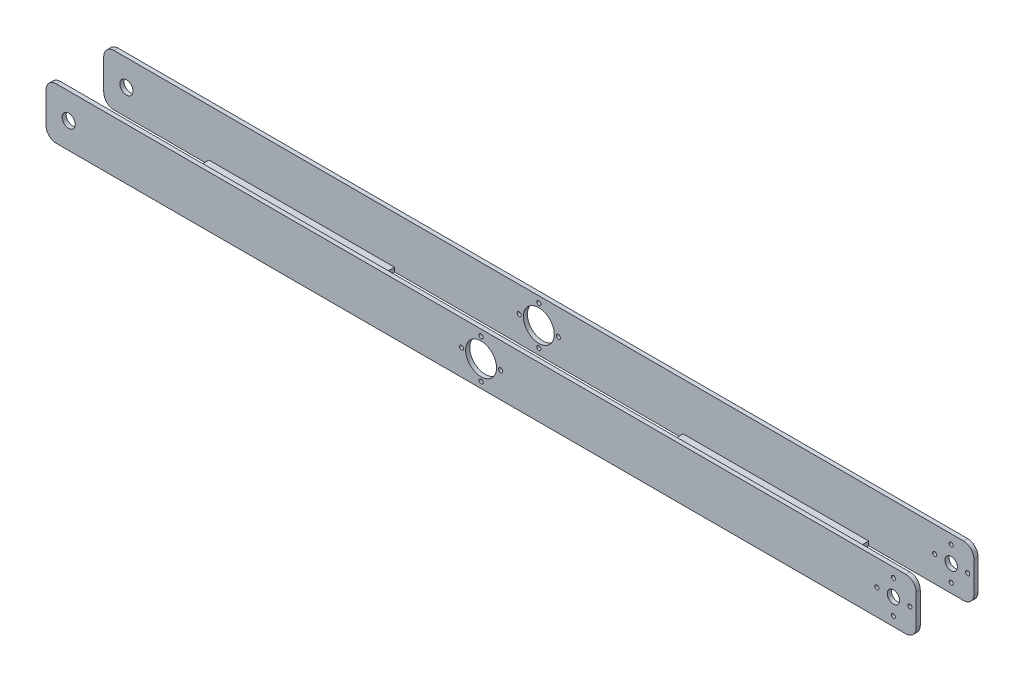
from build123d import *

# Parameters (mm, degrees)
SKETCH1_W               = 422
SKETCH1_H               = 25
BOSS_EXTRUDE1_DEPTH     = 30
SHELL1_T                = -2
SKETCH2_W               = 51
SKETCH2_H               = 26
SKETCH2_W_2             = 140
CUT_EXTRUDE1_DEPTH      = 215.583317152
SKETCH4_R               = 7.5
SKETCH4_R_2             = 3.2
SKETCH4_R_3             = 1
CUT_EXTRUDE3_DEPTH      = 214.488290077
CUT_EXTRUDE4_DEPTH      = 214.488290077
CUT_EXTRUDE4_DEPTH_BACK = 214.488290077
SKETCH5_R               = 3
SKETCH5_R_2             = 1
FILLET2_R               = 5


with BuildPart() as part:
    # Sketch1 → Boss-Extrude1 (new body)
    with BuildSketch(Plane.XY):
        Rectangle(SKETCH1_W, SKETCH1_H)
    extrude(amount=BOSS_EXTRUDE1_DEPTH)

    # Shell1
    shell1_openings = [part.faces().sort_by_distance(p)[0] for p in [
        (-211, 0, 15),
        (0, 12.5, 15),
        (211, 0, 15),
    ]]
    offset(amount=SHELL1_T, openings=shell1_openings, kind=Kind.INTERSECTION)

    # Sketch2 → Cut-Extrude1 (cut, through all)
    with BuildSketch(Plane(origin=(0, 12.5, 0), x_dir=(1, 0, 0), z_dir=(0, 1, 0))):
        with Locations((-185.5, -15)):
            Rectangle(SKETCH2_W, SKETCH2_H)
        with Locations((185.5, -15)):
            Rectangle(SKETCH2_W, SKETCH2_H)
        with Locations((0, -15)):
            Rectangle(SKETCH2_W_2, SKETCH2_H)
    extrude(amount=-CUT_EXTRUDE1_DEPTH, mode=Mode.SUBTRACT)

    # Sketch4 → Cut-Extrude3 (cut, through all)
    with BuildSketch(Plane.XY.offset(30)):
        Circle(SKETCH4_R)
        with Locations((-200, 0)):
            Circle(SKETCH4_R_2)
        with Locations((0, 9.5)):
            Circle(SKETCH4_R_3)
        with Locations((9.5, 0)):
            Circle(SKETCH4_R_3)
        with Locations((0, -9.5)):
            Circle(SKETCH4_R_3)
        with Locations((-9.5, 0)):
            Circle(SKETCH4_R_3)
    extrude(amount=-CUT_EXTRUDE3_DEPTH, mode=Mode.SUBTRACT)

    # Sketch5 → Cut-Extrude4 (cut, two sides: drawn at the far end of the back side and taken through both)
    with BuildSketch(Plane(origin=(0, 0, 0), x_dir=(-1, 0, 0), z_dir=(0, 0, -1)).offset(-CUT_EXTRUDE4_DEPTH_BACK)):
        with Locations(Location((-200, 0, 0), (0, 0, 180))):
            Circle(SKETCH5_R)
        with Locations(Location((-200, 8, 0), (0, 0, 180))):
            Circle(SKETCH5_R_2)
        with Locations(Location((-192, 0, 0), (0, 0, 180))):
            Circle(SKETCH5_R_2)
        with Locations(Location((-208, 0, 0), (0, 0, 180))):
            Circle(SKETCH5_R_2)
        with Locations(Location((-200, -8, 0), (0, 0, 180))):
            Circle(SKETCH5_R_2)
    extrude(amount=CUT_EXTRUDE4_DEPTH + CUT_EXTRUDE4_DEPTH_BACK, mode=Mode.SUBTRACT)

    # Fillet2
    fillet2_edges = [part.edges().sort_by_distance(p)[0] for p in [
        (-211, 12.5, 1),
        (211, 12.5, 1),
        (211, -12.5, 1),
        (-211, -12.5, 1),
        (211, -12.5, 29),
        (-211, -12.5, 29),
        (-211, 12.5, 29),
        (211, 12.5, 29),
    ]]
    fillet(fillet2_edges, radius=FILLET2_R)


solid = part.part
